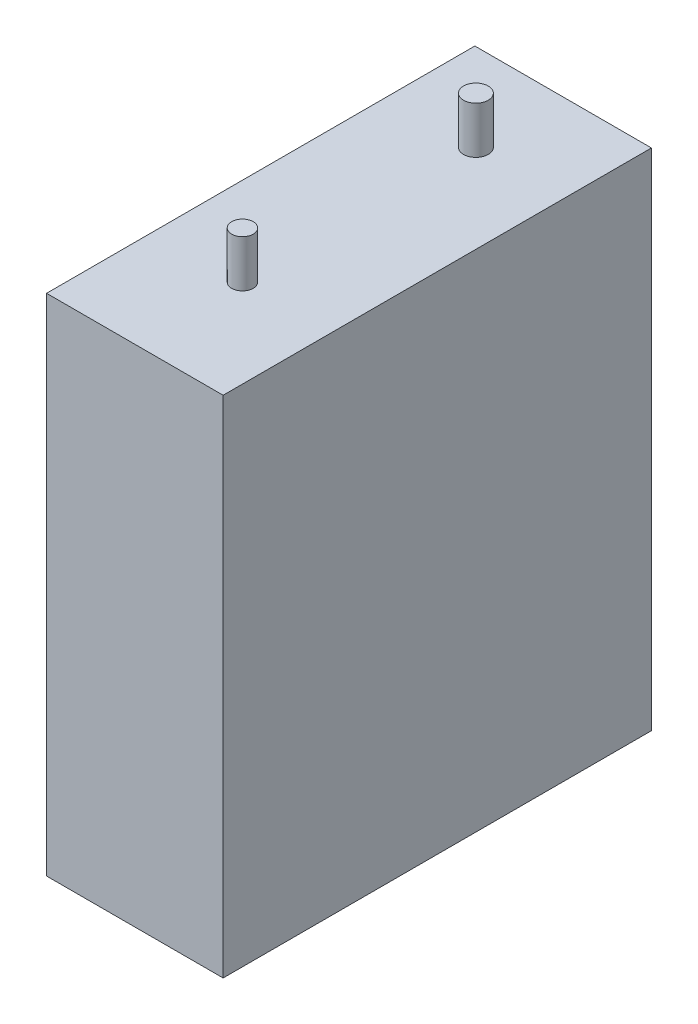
ISO-10303-21;
HEADER;
FILE_DESCRIPTION(('STEP AP214'),'2;1');
FILE_NAME('part.step','',(''),(''),'','','');
FILE_SCHEMA(('AUTOMOTIVE_DESIGN { 1 0 10303 214 1 1 1 1 }'));
ENDSEC;
DATA;
#1=APPLICATION_CONTEXT('core data for automotive mechanical design processes');
#2=APPLICATION_PROTOCOL_DEFINITION('international standard','automotive_design',2000,#1);
#3=PRODUCT_CONTEXT('',#1,'mechanical');
#4=PRODUCT('Part','Part','',(#3));
#5=PRODUCT_RELATED_PRODUCT_CATEGORY('part','',(#4));
#6=PRODUCT_DEFINITION_FORMATION('','',#4);
#7=PRODUCT_DEFINITION_CONTEXT('part definition',#1,'design');
#8=PRODUCT_DEFINITION('design','',#6,#7);
#9=PRODUCT_DEFINITION_SHAPE('','',#8);
#10=(LENGTH_UNIT() NAMED_UNIT(*) SI_UNIT(.MILLI.,.METRE.));
#11=(NAMED_UNIT(*) PLANE_ANGLE_UNIT() SI_UNIT($,.RADIAN.));
#12=(NAMED_UNIT(*) SI_UNIT($,.STERADIAN.) SOLID_ANGLE_UNIT());
#13=UNCERTAINTY_MEASURE_WITH_UNIT(LENGTH_MEASURE(1.E-05),#10,'distance_accuracy_value','');
#14=(GEOMETRIC_REPRESENTATION_CONTEXT(3) GLOBAL_UNCERTAINTY_ASSIGNED_CONTEXT((#13)) GLOBAL_UNIT_ASSIGNED_CONTEXT((#10,
#11,#12)) REPRESENTATION_CONTEXT('',''));
#15=CARTESIAN_POINT('',(0.,0.,0.));
#16=DIRECTION('',(0.,0.,1.));
#17=DIRECTION('',(1.,0.,0.));
#18=AXIS2_PLACEMENT_3D('',#15,#16,#17);
#19=CARTESIAN_POINT('',(35.814,-102.362,-86.868));
#20=DIRECTION('',(0.,0.,1.));
#21=DIRECTION('',(1.,0.,0.));
#22=AXIS2_PLACEMENT_3D('',#19,#20,#21);
#23=PLANE('',#22);
#24=DIRECTION('',(0.,1.,0.));
#25=VECTOR('',#24,1.);
#26=CARTESIAN_POINT('',(-35.814,-102.362,-86.868));
#27=LINE('',#26,#25);
#28=CARTESIAN_POINT('',(-35.814,-102.362,-86.868));
#29=VERTEX_POINT('',#28);
#30=CARTESIAN_POINT('',(-35.814,102.362,-86.868));
#31=VERTEX_POINT('',#30);
#32=EDGE_CURVE('E106',#29,#31,#27,.T.);
#33=ORIENTED_EDGE('',*,*,#32,.T.);
#34=DIRECTION('',(-1.,0.,0.));
#35=VECTOR('',#34,1.);
#36=CARTESIAN_POINT('',(35.814,102.362,-86.868));
#37=LINE('',#36,#35);
#38=CARTESIAN_POINT('',(35.814,102.362,-86.868));
#39=VERTEX_POINT('',#38);
#40=EDGE_CURVE('E97',#39,#31,#37,.T.);
#41=ORIENTED_EDGE('',*,*,#40,.F.);
#42=DIRECTION('',(0.,1.,0.));
#43=VECTOR('',#42,1.);
#44=CARTESIAN_POINT('',(35.814,-102.362,-86.868));
#45=LINE('',#44,#43);
#46=CARTESIAN_POINT('',(35.814,-102.362,-86.868));
#47=VERTEX_POINT('',#46);
#48=EDGE_CURVE('E91',#47,#39,#45,.T.);
#49=ORIENTED_EDGE('',*,*,#48,.F.);
#50=DIRECTION('',(-1.,0.,0.));
#51=VECTOR('',#50,1.);
#52=CARTESIAN_POINT('',(35.814,-102.362,-86.868));
#53=LINE('',#52,#51);
#54=EDGE_CURVE('E102',#47,#29,#53,.T.);
#55=ORIENTED_EDGE('',*,*,#54,.T.);
#56=EDGE_LOOP('',(#33,#41,#49,#55));
#57=FACE_BOUND('',#56,.T.);
#58=ADVANCED_FACE('F39',(#57),#23,.F.);
#59=CARTESIAN_POINT('',(35.814,102.362,86.868));
#60=DIRECTION('',(0.,-1.,0.));
#61=DIRECTION('',(0.,0.,-1.));
#62=AXIS2_PLACEMENT_3D('',#59,#60,#61);
#63=PLANE('',#62);
#64=CARTESIAN_POINT('',(0.,102.362,43.2183861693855));
#65=DIRECTION('',(0.,-1.,0.));
#66=DIRECTION('',(0.,0.,-1.));
#67=AXIS2_PLACEMENT_3D('',#64,#65,#66);
#68=CIRCLE('',#67,4.37713784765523);
#69=CARTESIAN_POINT('',(0.,102.362,38.8412483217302));
#70=VERTEX_POINT('',#69);
#71=EDGE_CURVE('E11',#70,#70,#68,.F.);
#72=ORIENTED_EDGE('',*,*,#71,.F.);
#73=EDGE_LOOP('',(#72));
#74=FACE_BOUND('',#73,.T.);
#75=CARTESIAN_POINT('',(0.,102.362,-51.4735835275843));
#76=DIRECTION('',(0.,-1.,0.));
#77=DIRECTION('',(0.,0.,-1.));
#78=AXIS2_PLACEMENT_3D('',#75,#76,#77);
#79=CIRCLE('',#78,5.0054486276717);
#80=CARTESIAN_POINT('',(0.,102.362,-56.479032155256));
#81=VERTEX_POINT('',#80);
#82=EDGE_CURVE('E47',#81,#81,#79,.F.);
#83=ORIENTED_EDGE('',*,*,#82,.F.);
#84=EDGE_LOOP('',(#83));
#85=FACE_BOUND('',#84,.T.);
#86=DIRECTION('',(0.,0.,1.));
#87=VECTOR('',#86,1.);
#88=CARTESIAN_POINT('',(-35.814,102.362,86.868));
#89=LINE('',#88,#87);
#90=CARTESIAN_POINT('',(-35.814,102.362,86.868));
#91=VERTEX_POINT('',#90);
#92=EDGE_CURVE('E96',#31,#91,#89,.T.);
#93=ORIENTED_EDGE('',*,*,#92,.T.);
#94=DIRECTION('',(-1.,0.,0.));
#95=VECTOR('',#94,1.);
#96=CARTESIAN_POINT('',(35.814,102.362,86.868));
#97=LINE('',#96,#95);
#98=CARTESIAN_POINT('',(35.814,102.362,86.868));
#99=VERTEX_POINT('',#98);
#100=EDGE_CURVE('E94',#99,#91,#97,.T.);
#101=ORIENTED_EDGE('',*,*,#100,.F.);
#102=DIRECTION('',(0.,0.,1.));
#103=VECTOR('',#102,1.);
#104=CARTESIAN_POINT('',(35.814,102.362,86.868));
#105=LINE('',#104,#103);
#106=EDGE_CURVE('E86',#39,#99,#105,.T.);
#107=ORIENTED_EDGE('',*,*,#106,.F.);
#108=ORIENTED_EDGE('',*,*,#40,.T.);
#109=EDGE_LOOP('',(#93,#101,#107,#108));
#110=FACE_BOUND('',#109,.T.);
#111=ADVANCED_FACE('F95',(#74,#85,#110),#63,.F.);
#112=CARTESIAN_POINT('',(35.814,-102.362,86.868));
#113=DIRECTION('',(0.,0.,-1.));
#114=DIRECTION('',(-1.,0.,0.));
#115=AXIS2_PLACEMENT_3D('',#112,#113,#114);
#116=PLANE('',#115);
#117=DIRECTION('',(0.,-1.,0.));
#118=VECTOR('',#117,1.);
#119=CARTESIAN_POINT('',(-35.814,-102.362,86.868));
#120=LINE('',#119,#118);
#121=CARTESIAN_POINT('',(-35.814,-102.362,86.868));
#122=VERTEX_POINT('',#121);
#123=EDGE_CURVE('E72',#91,#122,#120,.T.);
#124=ORIENTED_EDGE('',*,*,#123,.T.);
#125=DIRECTION('',(-1.,0.,0.));
#126=VECTOR('',#125,1.);
#127=CARTESIAN_POINT('',(35.814,-102.362,86.868));
#128=LINE('',#127,#126);
#129=CARTESIAN_POINT('',(35.814,-102.362,86.868));
#130=VERTEX_POINT('',#129);
#131=EDGE_CURVE('E98',#130,#122,#128,.T.);
#132=ORIENTED_EDGE('',*,*,#131,.F.);
#133=DIRECTION('',(0.,-1.,0.));
#134=VECTOR('',#133,1.);
#135=CARTESIAN_POINT('',(35.814,-102.362,86.868));
#136=LINE('',#135,#134);
#137=EDGE_CURVE('E89',#99,#130,#136,.T.);
#138=ORIENTED_EDGE('',*,*,#137,.F.);
#139=ORIENTED_EDGE('',*,*,#100,.T.);
#140=EDGE_LOOP('',(#124,#132,#138,#139));
#141=FACE_BOUND('',#140,.T.);
#142=ADVANCED_FACE('F100',(#141),#116,.F.);
#143=CARTESIAN_POINT('',(35.814,-102.362,86.868));
#144=DIRECTION('',(0.,1.,0.));
#145=DIRECTION('',(0.,0.,1.));
#146=AXIS2_PLACEMENT_3D('',#143,#144,#145);
#147=PLANE('',#146);
#148=DIRECTION('',(0.,0.,-1.));
#149=VECTOR('',#148,1.);
#150=CARTESIAN_POINT('',(-35.814,-102.362,86.868));
#151=LINE('',#150,#149);
#152=EDGE_CURVE('E78',#122,#29,#151,.T.);
#153=ORIENTED_EDGE('',*,*,#152,.T.);
#154=ORIENTED_EDGE('',*,*,#54,.F.);
#155=DIRECTION('',(0.,0.,-1.));
#156=VECTOR('',#155,1.);
#157=CARTESIAN_POINT('',(35.814,-102.362,86.868));
#158=LINE('',#157,#156);
#159=EDGE_CURVE('E55',#130,#47,#158,.T.);
#160=ORIENTED_EDGE('',*,*,#159,.F.);
#161=ORIENTED_EDGE('',*,*,#131,.T.);
#162=EDGE_LOOP('',(#153,#154,#160,#161));
#163=FACE_BOUND('',#162,.T.);
#164=ADVANCED_FACE('F126',(#163),#147,.F.);
#165=CARTESIAN_POINT('',(35.814,0.,0.));
#166=DIRECTION('',(-1.,0.,0.));
#167=DIRECTION('',(0.,0.,1.));
#168=AXIS2_PLACEMENT_3D('',#165,#166,#167);
#169=PLANE('',#168);
#170=ORIENTED_EDGE('',*,*,#48,.T.);
#171=ORIENTED_EDGE('',*,*,#106,.T.);
#172=ORIENTED_EDGE('',*,*,#137,.T.);
#173=ORIENTED_EDGE('',*,*,#159,.T.);
#174=EDGE_LOOP('',(#170,#171,#172,#173));
#175=FACE_BOUND('',#174,.T.);
#176=ADVANCED_FACE('F87',(#175),#169,.F.);
#177=CARTESIAN_POINT('',(-35.814,0.,0.));
#178=DIRECTION('',(-1.,0.,0.));
#179=DIRECTION('',(0.,0.,1.));
#180=AXIS2_PLACEMENT_3D('',#177,#178,#179);
#181=PLANE('',#180);
#182=ORIENTED_EDGE('',*,*,#32,.F.);
#183=ORIENTED_EDGE('',*,*,#152,.F.);
#184=ORIENTED_EDGE('',*,*,#123,.F.);
#185=ORIENTED_EDGE('',*,*,#92,.F.);
#186=EDGE_LOOP('',(#182,#183,#184,#185));
#187=FACE_BOUND('',#186,.T.);
#188=ADVANCED_FACE('F133',(#187),#181,.T.);
#189=CARTESIAN_POINT('',(0.,121.412,-51.4735835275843));
#190=DIRECTION('',(0.,-1.,0.));
#191=DIRECTION('',(0.,0.,-1.));
#192=AXIS2_PLACEMENT_3D('',#189,#190,#191);
#193=CYLINDRICAL_SURFACE('',#192,5.0054486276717);
#194=CARTESIAN_POINT('',(0.,121.412,-51.4735835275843));
#195=DIRECTION('',(0.,1.,0.));
#196=DIRECTION('',(0.,0.,1.));
#197=AXIS2_PLACEMENT_3D('',#194,#195,#196);
#198=CIRCLE('',#197,5.0054486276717);
#199=CARTESIAN_POINT('',(0.,121.412,-56.479032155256));
#200=VERTEX_POINT('',#199);
#201=EDGE_CURVE('E109',#200,#200,#198,.T.);
#202=CARTESIAN_POINT('',(0.,121.412,-56.479032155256));
#203=CARTESIAN_POINT('',(0.,121.2135625,-56.479032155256));
#204=CARTESIAN_POINT('',(0.,121.015125,-56.479032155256));
#205=CARTESIAN_POINT('',(0.,120.61825,-56.479032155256));
#206=CARTESIAN_POINT('',(0.,120.4198125,-56.479032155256));
#207=CARTESIAN_POINT('',(0.,120.0229375,-56.479032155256));
#208=CARTESIAN_POINT('',(0.,119.8245,-56.479032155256));
#209=CARTESIAN_POINT('',(0.,119.427625,-56.479032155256));
#210=CARTESIAN_POINT('',(0.,119.2291875,-56.479032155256));
#211=CARTESIAN_POINT('',(0.,118.8323125,-56.479032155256));
#212=CARTESIAN_POINT('',(0.,118.633875,-56.479032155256));
#213=CARTESIAN_POINT('',(0.,118.237,-56.479032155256));
#214=CARTESIAN_POINT('',(0.,118.0385625,-56.479032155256));
#215=CARTESIAN_POINT('',(0.,117.6416875,-56.479032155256));
#216=CARTESIAN_POINT('',(0.,117.44325,-56.479032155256));
#217=CARTESIAN_POINT('',(0.,117.046375,-56.479032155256));
#218=CARTESIAN_POINT('',(0.,116.8479375,-56.479032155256));
#219=CARTESIAN_POINT('',(0.,116.4510625,-56.479032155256));
#220=CARTESIAN_POINT('',(0.,116.252625,-56.479032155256));
#221=CARTESIAN_POINT('',(0.,115.85575,-56.479032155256));
#222=CARTESIAN_POINT('',(0.,115.6573125,-56.479032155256));
#223=CARTESIAN_POINT('',(0.,115.2604375,-56.479032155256));
#224=CARTESIAN_POINT('',(0.,115.062,-56.479032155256));
#225=CARTESIAN_POINT('',(0.,114.665125,-56.479032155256));
#226=CARTESIAN_POINT('',(0.,114.4666875,-56.479032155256));
#227=CARTESIAN_POINT('',(0.,114.0698125,-56.479032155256));
#228=CARTESIAN_POINT('',(0.,113.871375,-56.479032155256));
#229=CARTESIAN_POINT('',(0.,113.4745,-56.479032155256));
#230=CARTESIAN_POINT('',(0.,113.2760625,-56.479032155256));
#231=CARTESIAN_POINT('',(0.,112.8791875,-56.479032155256));
#232=CARTESIAN_POINT('',(0.,112.68075,-56.479032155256));
#233=CARTESIAN_POINT('',(0.,112.283875,-56.479032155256));
#234=CARTESIAN_POINT('',(0.,112.0854375,-56.479032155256));
#235=CARTESIAN_POINT('',(0.,111.6885625,-56.479032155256));
#236=CARTESIAN_POINT('',(0.,111.490125,-56.479032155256));
#237=CARTESIAN_POINT('',(0.,111.09325,-56.479032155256));
#238=CARTESIAN_POINT('',(0.,110.8948125,-56.479032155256));
#239=CARTESIAN_POINT('',(0.,110.4979375,-56.479032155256));
#240=CARTESIAN_POINT('',(0.,110.2995,-56.479032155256));
#241=CARTESIAN_POINT('',(0.,109.902625,-56.479032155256));
#242=CARTESIAN_POINT('',(0.,109.7041875,-56.479032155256));
#243=CARTESIAN_POINT('',(0.,109.3073125,-56.479032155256));
#244=CARTESIAN_POINT('',(0.,109.108875,-56.479032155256));
#245=CARTESIAN_POINT('',(0.,108.712,-56.479032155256));
#246=CARTESIAN_POINT('',(0.,108.5135625,-56.479032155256));
#247=CARTESIAN_POINT('',(0.,108.1166875,-56.479032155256));
#248=CARTESIAN_POINT('',(0.,107.91825,-56.479032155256));
#249=CARTESIAN_POINT('',(0.,107.521375,-56.479032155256));
#250=CARTESIAN_POINT('',(0.,107.3229375,-56.479032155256));
#251=CARTESIAN_POINT('',(0.,106.9260625,-56.479032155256));
#252=CARTESIAN_POINT('',(0.,106.727625,-56.479032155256));
#253=CARTESIAN_POINT('',(0.,106.33075,-56.479032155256));
#254=CARTESIAN_POINT('',(0.,106.1323125,-56.479032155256));
#255=CARTESIAN_POINT('',(0.,105.7354375,-56.479032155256));
#256=CARTESIAN_POINT('',(0.,105.537,-56.479032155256));
#257=CARTESIAN_POINT('',(0.,105.140125,-56.479032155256));
#258=CARTESIAN_POINT('',(0.,104.9416875,-56.479032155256));
#259=CARTESIAN_POINT('',(0.,104.5448125,-56.479032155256));
#260=CARTESIAN_POINT('',(0.,104.346375,-56.479032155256));
#261=CARTESIAN_POINT('',(0.,103.9495,-56.479032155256));
#262=CARTESIAN_POINT('',(0.,103.7510625,-56.479032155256));
#263=CARTESIAN_POINT('',(0.,103.3541875,-56.479032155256));
#264=CARTESIAN_POINT('',(0.,103.15575,-56.479032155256));
#265=CARTESIAN_POINT('',(0.,102.758875,-56.479032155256));
#266=CARTESIAN_POINT('',(0.,102.5604375,-56.479032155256));
#267=CARTESIAN_POINT('',(0.,102.362,-56.479032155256));
#268=B_SPLINE_CURVE_WITH_KNOTS('',3,(#202,#203,#204,#205,#206,#207,#208,#209,#210,#211,#212,
#213,#214,#215,#216,#217,#218,#219,#220,#221,#222,#223,#224,#225,#226,#227,#228,#229,#230,#231,
#232,#233,#234,#235,#236,#237,#238,#239,#240,#241,#242,#243,#244,#245,#246,#247,#248,#249,#250,
#251,#252,#253,#254,#255,#256,#257,#258,#259,#260,#261,#262,#263,#264,#265,#266,#267),
.UNSPECIFIED.,.F.,.F.,(4,2,2,2,2,2,2,2,2,2,2,2,2,2,2,2,2,2,2,2,2,2,2,2,2,2,2,2,2,2,2,2,4),(0.,
0.595312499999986,1.19062499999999,1.78593749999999,2.38124999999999,2.97656249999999,
3.57187499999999,4.16718749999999,4.76249999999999,5.35781249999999,5.95312499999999,
6.54843749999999,7.14374999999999,7.73906249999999,8.33437499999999,8.92968749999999,
9.52499999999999,10.1203125,10.715625,11.3109375,11.90625,12.5015625,13.096875,13.6921875,
14.2875,14.8828125,15.478125,16.0734375,16.66875,17.2640625,17.859375,18.4546875,19.05),.UNSPECIFIED.);
#269=EDGE_CURVE('BSEAM118',#200,#81,#268,.T.);
#270=ORIENTED_EDGE('',*,*,#201,.F.);
#271=ORIENTED_EDGE('',*,*,#82,.T.);
#272=ORIENTED_EDGE('',*,*,#269,.T.);
#273=ORIENTED_EDGE('',*,*,#269,.F.);
#274=EDGE_LOOP('',(#270,#272,#271,#273));
#275=FACE_BOUND('',#274,.T.);
#276=ADVANCED_FACE('F118',(#275),#193,.T.);
#277=CARTESIAN_POINT('',(0.,121.412,-51.4735835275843));
#278=DIRECTION('',(0.,1.,0.));
#279=DIRECTION('',(0.,0.,1.));
#280=AXIS2_PLACEMENT_3D('',#277,#278,#279);
#281=PLANE('',#280);
#282=ORIENTED_EDGE('',*,*,#201,.T.);
#283=EDGE_LOOP('',(#282));
#284=FACE_BOUND('',#283,.T.);
#285=ADVANCED_FACE('F141',(#284),#281,.T.);
#286=CARTESIAN_POINT('',(0.,121.412,43.2183861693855));
#287=DIRECTION('',(0.,-1.,0.));
#288=DIRECTION('',(0.,0.,-1.));
#289=AXIS2_PLACEMENT_3D('',#286,#287,#288);
#290=CYLINDRICAL_SURFACE('',#289,4.37713784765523);
#291=CARTESIAN_POINT('',(0.,121.412,43.2183861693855));
#292=DIRECTION('',(0.,1.,0.));
#293=DIRECTION('',(0.,0.,1.));
#294=AXIS2_PLACEMENT_3D('',#291,#292,#293);
#295=CIRCLE('',#294,4.37713784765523);
#296=CARTESIAN_POINT('',(0.,121.412,38.8412483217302));
#297=VERTEX_POINT('',#296);
#298=EDGE_CURVE('E158',#297,#297,#295,.T.);
#299=CARTESIAN_POINT('',(0.,121.412,38.8412483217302));
#300=CARTESIAN_POINT('',(0.,121.2135625,38.8412483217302));
#301=CARTESIAN_POINT('',(0.,121.015125,38.8412483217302));
#302=CARTESIAN_POINT('',(0.,120.61825,38.8412483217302));
#303=CARTESIAN_POINT('',(0.,120.4198125,38.8412483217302));
#304=CARTESIAN_POINT('',(0.,120.0229375,38.8412483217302));
#305=CARTESIAN_POINT('',(0.,119.8245,38.8412483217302));
#306=CARTESIAN_POINT('',(0.,119.427625,38.8412483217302));
#307=CARTESIAN_POINT('',(0.,119.2291875,38.8412483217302));
#308=CARTESIAN_POINT('',(0.,118.8323125,38.8412483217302));
#309=CARTESIAN_POINT('',(0.,118.633875,38.8412483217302));
#310=CARTESIAN_POINT('',(0.,118.237,38.8412483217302));
#311=CARTESIAN_POINT('',(0.,118.0385625,38.8412483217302));
#312=CARTESIAN_POINT('',(0.,117.6416875,38.8412483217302));
#313=CARTESIAN_POINT('',(0.,117.44325,38.8412483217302));
#314=CARTESIAN_POINT('',(0.,117.046375,38.8412483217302));
#315=CARTESIAN_POINT('',(0.,116.8479375,38.8412483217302));
#316=CARTESIAN_POINT('',(0.,116.4510625,38.8412483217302));
#317=CARTESIAN_POINT('',(0.,116.252625,38.8412483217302));
#318=CARTESIAN_POINT('',(0.,115.85575,38.8412483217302));
#319=CARTESIAN_POINT('',(0.,115.6573125,38.8412483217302));
#320=CARTESIAN_POINT('',(0.,115.2604375,38.8412483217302));
#321=CARTESIAN_POINT('',(0.,115.062,38.8412483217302));
#322=CARTESIAN_POINT('',(0.,114.665125,38.8412483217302));
#323=CARTESIAN_POINT('',(0.,114.4666875,38.8412483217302));
#324=CARTESIAN_POINT('',(0.,114.0698125,38.8412483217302));
#325=CARTESIAN_POINT('',(0.,113.871375,38.8412483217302));
#326=CARTESIAN_POINT('',(0.,113.4745,38.8412483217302));
#327=CARTESIAN_POINT('',(0.,113.2760625,38.8412483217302));
#328=CARTESIAN_POINT('',(0.,112.8791875,38.8412483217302));
#329=CARTESIAN_POINT('',(0.,112.68075,38.8412483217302));
#330=CARTESIAN_POINT('',(0.,112.283875,38.8412483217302));
#331=CARTESIAN_POINT('',(0.,112.0854375,38.8412483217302));
#332=CARTESIAN_POINT('',(0.,111.6885625,38.8412483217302));
#333=CARTESIAN_POINT('',(0.,111.490125,38.8412483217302));
#334=CARTESIAN_POINT('',(0.,111.09325,38.8412483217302));
#335=CARTESIAN_POINT('',(0.,110.8948125,38.8412483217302));
#336=CARTESIAN_POINT('',(0.,110.4979375,38.8412483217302));
#337=CARTESIAN_POINT('',(0.,110.2995,38.8412483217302));
#338=CARTESIAN_POINT('',(0.,109.902625,38.8412483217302));
#339=CARTESIAN_POINT('',(0.,109.7041875,38.8412483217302));
#340=CARTESIAN_POINT('',(0.,109.3073125,38.8412483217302));
#341=CARTESIAN_POINT('',(0.,109.108875,38.8412483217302));
#342=CARTESIAN_POINT('',(0.,108.712,38.8412483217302));
#343=CARTESIAN_POINT('',(0.,108.5135625,38.8412483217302));
#344=CARTESIAN_POINT('',(0.,108.1166875,38.8412483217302));
#345=CARTESIAN_POINT('',(0.,107.91825,38.8412483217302));
#346=CARTESIAN_POINT('',(0.,107.521375,38.8412483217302));
#347=CARTESIAN_POINT('',(0.,107.3229375,38.8412483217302));
#348=CARTESIAN_POINT('',(0.,106.9260625,38.8412483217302));
#349=CARTESIAN_POINT('',(0.,106.727625,38.8412483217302));
#350=CARTESIAN_POINT('',(0.,106.33075,38.8412483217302));
#351=CARTESIAN_POINT('',(0.,106.1323125,38.8412483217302));
#352=CARTESIAN_POINT('',(0.,105.7354375,38.8412483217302));
#353=CARTESIAN_POINT('',(0.,105.537,38.8412483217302));
#354=CARTESIAN_POINT('',(0.,105.140125,38.8412483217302));
#355=CARTESIAN_POINT('',(0.,104.9416875,38.8412483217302));
#356=CARTESIAN_POINT('',(0.,104.5448125,38.8412483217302));
#357=CARTESIAN_POINT('',(0.,104.346375,38.8412483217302));
#358=CARTESIAN_POINT('',(0.,103.9495,38.8412483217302));
#359=CARTESIAN_POINT('',(0.,103.7510625,38.8412483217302));
#360=CARTESIAN_POINT('',(0.,103.3541875,38.8412483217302));
#361=CARTESIAN_POINT('',(0.,103.15575,38.8412483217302));
#362=CARTESIAN_POINT('',(0.,102.758875,38.8412483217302));
#363=CARTESIAN_POINT('',(0.,102.5604375,38.8412483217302));
#364=CARTESIAN_POINT('',(0.,102.362,38.8412483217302));
#365=B_SPLINE_CURVE_WITH_KNOTS('',3,(#299,#300,#301,#302,#303,#304,#305,#306,#307,#308,#309,
#310,#311,#312,#313,#314,#315,#316,#317,#318,#319,#320,#321,#322,#323,#324,#325,#326,#327,#328,
#329,#330,#331,#332,#333,#334,#335,#336,#337,#338,#339,#340,#341,#342,#343,#344,#345,#346,#347,
#348,#349,#350,#351,#352,#353,#354,#355,#356,#357,#358,#359,#360,#361,#362,#363,#364),
.UNSPECIFIED.,.F.,.F.,(4,2,2,2,2,2,2,2,2,2,2,2,2,2,2,2,2,2,2,2,2,2,2,2,2,2,2,2,2,2,2,2,4),(0.,
0.595312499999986,1.19062499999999,1.78593749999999,2.38124999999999,2.97656249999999,
3.57187499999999,4.16718749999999,4.76249999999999,5.35781249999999,5.95312499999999,
6.54843749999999,7.14374999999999,7.73906249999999,8.33437499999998,8.92968749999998,
9.52499999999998,10.1203125,10.715625,11.3109375,11.90625,12.5015625,13.096875,13.6921875,
14.2875,14.8828125,15.478125,16.0734375,16.66875,17.2640625,17.859375,18.4546875,19.05),.UNSPECIFIED.);
#366=EDGE_CURVE('BSEAM145',#297,#70,#365,.T.);
#367=ORIENTED_EDGE('',*,*,#298,.F.);
#368=ORIENTED_EDGE('',*,*,#71,.T.);
#369=ORIENTED_EDGE('',*,*,#366,.T.);
#370=ORIENTED_EDGE('',*,*,#366,.F.);
#371=EDGE_LOOP('',(#367,#369,#368,#370));
#372=FACE_BOUND('',#371,.T.);
#373=ADVANCED_FACE('F145',(#372),#290,.T.);
#374=CARTESIAN_POINT('',(0.,121.412,43.2183861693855));
#375=DIRECTION('',(0.,1.,0.));
#376=DIRECTION('',(0.,0.,1.));
#377=AXIS2_PLACEMENT_3D('',#374,#375,#376);
#378=PLANE('',#377);
#379=ORIENTED_EDGE('',*,*,#298,.T.);
#380=EDGE_LOOP('',(#379));
#381=FACE_BOUND('',#380,.T.);
#382=ADVANCED_FACE('F147',(#381),#378,.T.);
#383=CLOSED_SHELL('',(#58,#111,#142,#164,#176,#188,#276,#285,#373,#382));
#384=MANIFOLD_SOLID_BREP('B2',#383);
#385=ADVANCED_BREP_SHAPE_REPRESENTATION('',(#18,#384),#14);
#386=SHAPE_DEFINITION_REPRESENTATION(#9,#385);
ENDSEC;
END-ISO-10303-21;
